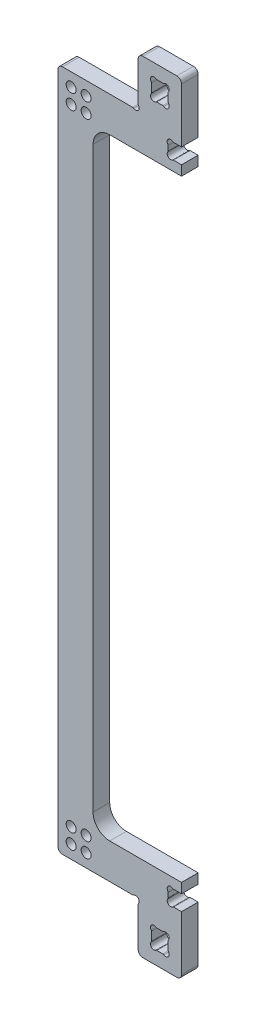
from build123d import *

# Parameters (mm, degrees)
BOSS_EXTRU_2_DEPTH      = 25
ESQUISSE3_R             = 7.5
ENL_V_MAT_EXTRU_2_DEPTH = 600.822173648
CONG_1_R                = 7


with BuildPart() as part:
    # Esquisse2 → Boss.-Extru.2 (new body)
    with BuildSketch(Plane.XY):
        with BuildLine():
            Line((0, 0), (65.2, 0))
            Line((65.2, 0), (65.2, 89.066666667))
            Line((65.2, 89.066666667), (53.231040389, 89.066666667))
            ThreePointArc((53.231040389, 89.066666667), (52.447325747, 88.94064884), (51.742620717, 88.575299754))
            ThreePointArc((51.742620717, 88.575299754), (45.1, 89.066666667), (44.608633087, 95.709287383))
            ThreePointArc((44.608633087, 95.709287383), (44.973982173, 96.413992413), (45.1, 97.197707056))
            Line((45.1, 97.197707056), (45.1, 104.135626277))
            ThreePointArc((45.1, 104.135626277), (44.973982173, 104.91934092), (44.608633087, 105.62404595))
            ThreePointArc((44.608633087, 105.62404595), (45.1, 112.266666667), (51.742620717, 112.75803358))
            ThreePointArc((51.742620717, 112.75803358), (52.447325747, 112.392684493), (53.231040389, 112.266666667))
            Line((53.231040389, 112.266666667), (65.2, 112.266666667))
            Line((65.2, 112.266666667), (65.2, 127.166666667))
            Line((65.2, 127.166666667), (-42.8, 127.166666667))
            ThreePointArc((-42.8, 127.166666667), (-60.47766953, 134.488997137), (-67.8, 152.166666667))
            Line((-67.8, 152.166666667), (-67.8, 587))
            Line((-67.8, 587), (-120.8, 587))
            Line((-120.8, 587), (-120.8, 74.166666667))
            Line((-120.8, 74.166666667), (-8.131040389, 74.166666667))
            ThreePointArc((-8.131040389, 74.166666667), (-7.347325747, 74.292684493), (-6.642620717, 74.65803358))
            ThreePointArc((-6.642620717, 74.65803358), (0, 74.166666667), (0.491366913, 67.52404595))
            ThreePointArc((0.491366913, 67.52404595), (0.126017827, 66.81934092), (0, 66.035626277))
            Line((0, 66.035626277), (0, 0))
        make_face()
        with BuildLine():
            Line((45.2, 41.035626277), (45.2, 28.131040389))
            ThreePointArc((45.2, 28.131040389), (45.326017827, 27.347325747), (45.691366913, 26.642620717))
            ThreePointArc((45.691366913, 26.642620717), (45.2, 20), (38.557379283, 19.508633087))
            ThreePointArc((38.557379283, 19.508633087), (37.852674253, 19.873982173), (37.068959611, 20))
            Line((37.068959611, 20), (28.131040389, 20))
            ThreePointArc((28.131040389, 20), (27.347325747, 19.873982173), (26.642620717, 19.508633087))
            ThreePointArc((26.642620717, 19.508633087), (20, 20), (19.508633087, 26.642620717))
            ThreePointArc((19.508633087, 26.642620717), (19.873982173, 27.347325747), (20, 28.131040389))
            Line((20, 28.131040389), (20, 41.035626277))
            ThreePointArc((20, 41.035626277), (19.873982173, 41.81934092), (19.508633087, 42.52404595))
            ThreePointArc((19.508633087, 42.52404595), (20, 49.166666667), (26.642620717, 49.65803358))
            ThreePointArc((26.642620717, 49.65803358), (27.347325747, 49.292684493), (28.131040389, 49.166666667))
            Line((28.131040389, 49.166666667), (37.068959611, 49.166666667))
            ThreePointArc((37.068959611, 49.166666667), (37.852674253, 49.292684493), (38.557379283, 49.65803358))
            ThreePointArc((38.557379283, 49.65803358), (45.2, 49.166666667), (45.691366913, 42.52404595))
            ThreePointArc((45.691366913, 42.52404595), (45.326017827, 41.81934092), (45.2, 41.035626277))
        make_face(mode=Mode.SUBTRACT)
    extrude(amount=BOSS_EXTRU_2_DEPTH)

    # Esquisse3 → Enl_v. mat.-Extru.2 (cut, through all)
    with BuildSketch(Plane.XY.offset(25)):
        with Locations((-100.8, 94.166666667)):
            Circle(ESQUISSE3_R)
        with Locations((-78.3, 94.166666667)):
            Circle(ESQUISSE3_R)
        with Locations((-78.3, 116.666666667)):
            Circle(ESQUISSE3_R)
        with Locations((-100.8, 116.666666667)):
            Circle(ESQUISSE3_R)
    extrude(amount=-ENL_V_MAT_EXTRU_2_DEPTH, mode=Mode.SUBTRACT)

    # Cong_1
    cong_1_edges = [part.edges().sort_by_distance(p)[0] for p in [
        (-120.8, 74.166666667, 12.5),
        (65.2, 0, 12.5),
        (0, 0, 12.5),
    ]]
    fillet(cong_1_edges, radius=CONG_1_R)

    # Sym_trie1: part across plane


with BuildPart() as part_1:
    add(part.part)
    add(part.part.mirror(Plane(origin=(-67.8, 587, 25), x_dir=(0, 0, 1), z_dir=(0, -1, 0))))


solid = part_1.part
